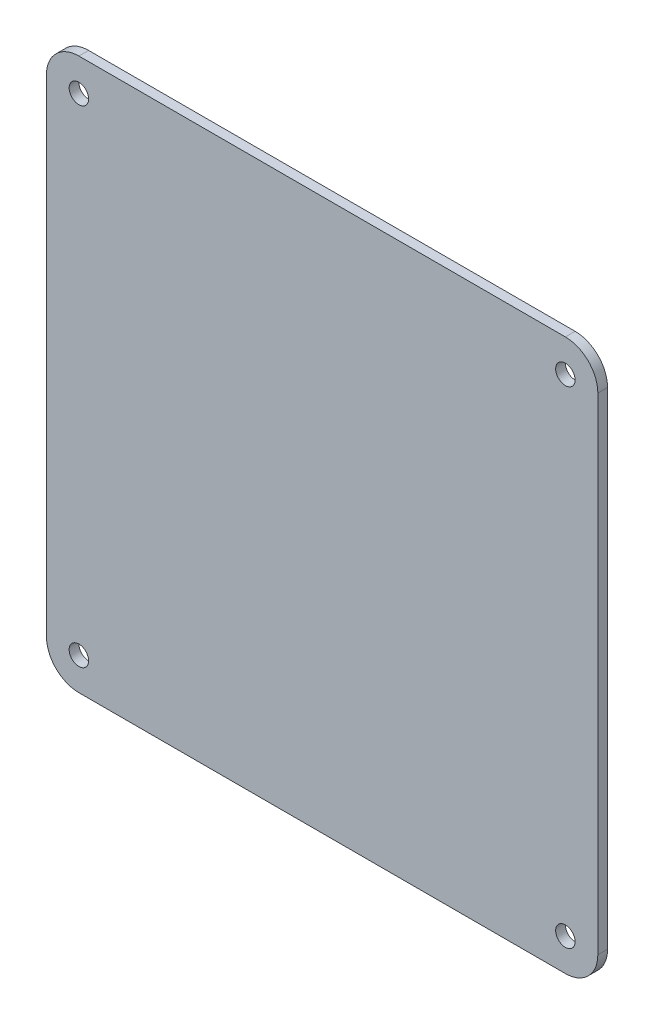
from build123d import *

# Parameters (mm, degrees)
SKETCH1_R           = 3
BOSS_EXTRUDE1_DEPTH = 3


with BuildPart() as part:
    # Sketch1 → Boss-Extrude1 (new body)
    with BuildSketch(Plane.XY):
        with BuildLine():
            Line((75, -85), (-75, -85))
            ThreePointArc((-75, -85), (-82.071067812, -82.071067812), (-85, -75))
            Line((-85, -75), (-85, 75))
            ThreePointArc((-85, 75), (-82.071067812, 82.071067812), (-75, 85))
            Line((-75, 85), (75, 85))
            ThreePointArc((75, 85), (82.071067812, 82.071067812), (85, 75))
            Line((85, 75), (85, -75))
            ThreePointArc((85, -75), (82.071067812, -82.071067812), (75, -85))
        make_face()
        with Locations((-75, 75)):
            Circle(SKETCH1_R, mode=Mode.SUBTRACT)
        with Locations(Location((75, 75, 0), (0, 0, 180))):
            Circle(SKETCH1_R, mode=Mode.SUBTRACT)
        with Locations((75, -75)):
            Circle(SKETCH1_R, mode=Mode.SUBTRACT)
        with Locations(Location((-75, -75, 0), (0, 0, 180))):
            Circle(SKETCH1_R, mode=Mode.SUBTRACT)
    extrude(amount=BOSS_EXTRUDE1_DEPTH)


solid = part.part
